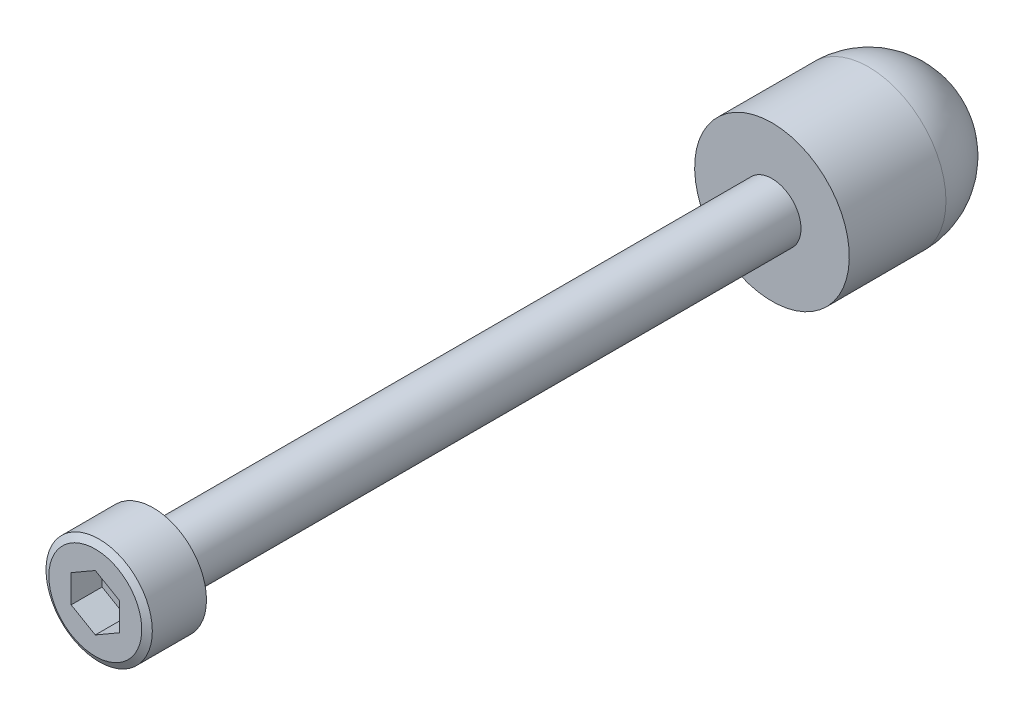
ISO-10303-21;
HEADER;
FILE_DESCRIPTION(('STEP AP214'),'2;1');
FILE_NAME('part.step','',(''),(''),'','','');
FILE_SCHEMA(('AUTOMOTIVE_DESIGN { 1 0 10303 214 1 1 1 1 }'));
ENDSEC;
DATA;
#1=APPLICATION_CONTEXT('core data for automotive mechanical design processes');
#2=APPLICATION_PROTOCOL_DEFINITION('international standard','automotive_design',2000,#1);
#3=PRODUCT_CONTEXT('',#1,'mechanical');
#4=PRODUCT('Part','Part','',(#3));
#5=PRODUCT_RELATED_PRODUCT_CATEGORY('part','',(#4));
#6=PRODUCT_DEFINITION_FORMATION('','',#4);
#7=PRODUCT_DEFINITION_CONTEXT('part definition',#1,'design');
#8=PRODUCT_DEFINITION('design','',#6,#7);
#9=PRODUCT_DEFINITION_SHAPE('','',#8);
#10=(LENGTH_UNIT() NAMED_UNIT(*) SI_UNIT(.MILLI.,.METRE.));
#11=(NAMED_UNIT(*) PLANE_ANGLE_UNIT() SI_UNIT($,.RADIAN.));
#12=(NAMED_UNIT(*) SI_UNIT($,.STERADIAN.) SOLID_ANGLE_UNIT());
#13=UNCERTAINTY_MEASURE_WITH_UNIT(LENGTH_MEASURE(1.E-05),#10,'distance_accuracy_value','');
#14=(GEOMETRIC_REPRESENTATION_CONTEXT(3) GLOBAL_UNCERTAINTY_ASSIGNED_CONTEXT((#13)) GLOBAL_UNIT_ASSIGNED_CONTEXT((#10,
#11,#12)) REPRESENTATION_CONTEXT('',''));
#15=CARTESIAN_POINT('',(0.,0.,0.));
#16=DIRECTION('',(0.,0.,1.));
#17=DIRECTION('',(1.,0.,0.));
#18=AXIS2_PLACEMENT_3D('',#15,#16,#17);
#19=CARTESIAN_POINT('',(-2.432432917,-2.44080280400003,44.));
#20=DIRECTION('',(0.,0.,1.));
#21=DIRECTION('',(1.,0.,0.));
#22=AXIS2_PLACEMENT_3D('',#19,#20,#21);
#23=PLANE('',#22);
#24=DIRECTION('',(-0.866025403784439,0.5,0.));
#25=VECTOR('',#24,1.);
#26=CARTESIAN_POINT('',(1.25,0.721687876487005,44.));
#27=LINE('',#26,#25);
#28=CARTESIAN_POINT('',(1.25,0.721687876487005,44.));
#29=VERTEX_POINT('',#28);
#30=CARTESIAN_POINT('',(0.,1.44337571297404,44.));
#31=VERTEX_POINT('',#30);
#32=EDGE_CURVE('E31',#29,#31,#27,.T.);
#33=ORIENTED_EDGE('',*,*,#32,.F.);
#34=DIRECTION('',(0.,1.,0.));
#35=VECTOR('',#34,1.);
#36=CARTESIAN_POINT('',(1.25,-0.721687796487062,44.));
#37=LINE('',#36,#35);
#38=CARTESIAN_POINT('',(1.25,-0.721687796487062,44.));
#39=VERTEX_POINT('',#38);
#40=EDGE_CURVE('E90',#39,#29,#37,.T.);
#41=ORIENTED_EDGE('',*,*,#40,.F.);
#42=DIRECTION('',(0.866025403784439,0.5,0.));
#43=VECTOR('',#42,1.);
#44=CARTESIAN_POINT('',(0.,-1.44337563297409,44.));
#45=LINE('',#44,#43);
#46=CARTESIAN_POINT('',(0.,-1.44337563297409,44.));
#47=VERTEX_POINT('',#46);
#48=EDGE_CURVE('E93',#47,#39,#45,.T.);
#49=ORIENTED_EDGE('',*,*,#48,.F.);
#50=DIRECTION('',(0.866025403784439,-0.5,0.));
#51=VECTOR('',#50,1.);
#52=CARTESIAN_POINT('',(-1.25,-0.72168779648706,44.));
#53=LINE('',#52,#51);
#54=CARTESIAN_POINT('',(-1.25,-0.72168779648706,44.));
#55=VERTEX_POINT('',#54);
#56=EDGE_CURVE('E109',#55,#47,#53,.T.);
#57=ORIENTED_EDGE('',*,*,#56,.F.);
#58=DIRECTION('',(0.,-1.,0.));
#59=VECTOR('',#58,1.);
#60=CARTESIAN_POINT('',(-1.25,0.721687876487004,44.));
#61=LINE('',#60,#59);
#62=CARTESIAN_POINT('',(-1.25,0.721687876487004,44.));
#63=VERTEX_POINT('',#62);
#64=EDGE_CURVE('E106',#63,#55,#61,.T.);
#65=ORIENTED_EDGE('',*,*,#64,.F.);
#66=DIRECTION('',(-0.866025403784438,-0.5,0.));
#67=VECTOR('',#66,1.);
#68=CARTESIAN_POINT('',(0.,1.44337571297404,44.));
#69=LINE('',#68,#67);
#70=EDGE_CURVE('E104',#31,#63,#69,.T.);
#71=ORIENTED_EDGE('',*,*,#70,.F.);
#72=EDGE_LOOP('',(#33,#41,#49,#57,#65,#71));
#73=FACE_BOUND('',#72,.T.);
#74=CARTESIAN_POINT('',(0.,3.99999715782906E-08,44.));
#75=DIRECTION('',(0.,0.,-1.));
#76=DIRECTION('',(-1.,0.,0.));
#77=AXIS2_PLACEMENT_3D('',#74,#75,#76);
#78=CIRCLE('',#77,2.403589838);
#79=CARTESIAN_POINT('',(-2.403589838,3.99999715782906E-08,44.));
#80=VERTEX_POINT('',#79);
#81=EDGE_CURVE('E18',#80,#80,#78,.T.);
#82=ORIENTED_EDGE('',*,*,#81,.F.);
#83=EDGE_LOOP('',(#82));
#84=FACE_BOUND('',#83,.T.);
#85=ADVANCED_FACE('F14',(#73,#84),#23,.T.);
#86=CARTESIAN_POINT('',(0.,3.99999715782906E-08,44.));
#87=DIRECTION('',(0.,0.,-1.));
#88=DIRECTION('',(-1.,0.,0.));
#89=AXIS2_PLACEMENT_3D('',#86,#87,#88);
#90=CONICAL_SURFACE('',#89,2.403589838,1.04719755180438);
#91=ORIENTED_EDGE('',*,*,#81,.T.);
#92=EDGE_LOOP('',(#91));
#93=FACE_BOUND('',#92,.T.);
#94=CARTESIAN_POINT('',(0.,3.99999715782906E-08,43.8));
#95=DIRECTION('',(0.,0.,1.));
#96=DIRECTION('',(1.,0.,0.));
#97=AXIS2_PLACEMENT_3D('',#94,#95,#96);
#98=CIRCLE('',#97,2.75);
#99=CARTESIAN_POINT('',(2.75,3.99999715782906E-08,43.8));
#100=VERTEX_POINT('',#99);
#101=EDGE_CURVE('E159',#100,#100,#98,.F.);
#102=ORIENTED_EDGE('',*,*,#101,.F.);
#103=EDGE_LOOP('',(#102));
#104=FACE_BOUND('',#103,.T.);
#105=ADVANCED_FACE('F138',(#93,#104),#90,.T.);
#106=CARTESIAN_POINT('',(0.,3.99999715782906E-08,41.));
#107=DIRECTION('',(0.,0.,1.));
#108=DIRECTION('',(1.,0.,0.));
#109=AXIS2_PLACEMENT_3D('',#106,#107,#108);
#110=CYLINDRICAL_SURFACE('',#109,2.75);
#111=CARTESIAN_POINT('',(0.,3.99999715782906E-08,41.));
#112=DIRECTION('',(0.,0.,1.));
#113=DIRECTION('',(1.,0.,0.));
#114=AXIS2_PLACEMENT_3D('',#111,#112,#113);
#115=CIRCLE('',#114,2.75);
#116=CARTESIAN_POINT('',(2.75,3.99999715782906E-08,41.));
#117=VERTEX_POINT('',#116);
#118=EDGE_CURVE('E158',#117,#117,#115,.F.);
#119=ORIENTED_EDGE('',*,*,#118,.F.);
#120=EDGE_LOOP('',(#119));
#121=FACE_BOUND('',#120,.T.);
#122=ORIENTED_EDGE('',*,*,#101,.T.);
#123=EDGE_LOOP('',(#122));
#124=FACE_BOUND('',#123,.T.);
#125=ADVANCED_FACE('F142',(#121,#124),#110,.T.);
#126=CARTESIAN_POINT('',(2.783,-2.79257617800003,41.));
#127=DIRECTION('',(0.,0.,-1.));
#128=DIRECTION('',(-1.,0.,0.));
#129=AXIS2_PLACEMENT_3D('',#126,#127,#128);
#130=PLANE('',#129);
#131=CARTESIAN_POINT('',(0.,3.99999715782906E-08,41.));
#132=DIRECTION('',(0.,0.,1.));
#133=DIRECTION('',(1.,0.,0.));
#134=AXIS2_PLACEMENT_3D('',#131,#132,#133);
#135=CIRCLE('',#134,1.5);
#136=CARTESIAN_POINT('',(1.5,3.99999715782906E-08,41.));
#137=VERTEX_POINT('',#136);
#138=EDGE_CURVE('E155',#137,#137,#135,.F.);
#139=ORIENTED_EDGE('',*,*,#138,.F.);
#140=EDGE_LOOP('',(#139));
#141=FACE_BOUND('',#140,.T.);
#142=ORIENTED_EDGE('',*,*,#118,.T.);
#143=EDGE_LOOP('',(#142));
#144=FACE_BOUND('',#143,.T.);
#145=ADVANCED_FACE('F140',(#141,#144),#130,.T.);
#146=CARTESIAN_POINT('',(0.,3.99999715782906E-08,9.));
#147=DIRECTION('',(0.,0.,1.));
#148=DIRECTION('',(1.,0.,0.));
#149=AXIS2_PLACEMENT_3D('',#146,#147,#148);
#150=CYLINDRICAL_SURFACE('',#149,1.5);
#151=CARTESIAN_POINT('',(0.,3.99999715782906E-08,9.));
#152=DIRECTION('',(0.,0.,1.));
#153=DIRECTION('',(1.,0.,0.));
#154=AXIS2_PLACEMENT_3D('',#151,#152,#153);
#155=CIRCLE('',#154,1.5);
#156=CARTESIAN_POINT('',(1.5,3.99999715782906E-08,9.));
#157=VERTEX_POINT('',#156);
#158=EDGE_CURVE('E160',#157,#157,#155,.F.);
#159=ORIENTED_EDGE('',*,*,#158,.F.);
#160=EDGE_LOOP('',(#159));
#161=FACE_BOUND('',#160,.T.);
#162=ORIENTED_EDGE('',*,*,#138,.T.);
#163=EDGE_LOOP('',(#162));
#164=FACE_BOUND('',#163,.T.);
#165=ADVANCED_FACE('F132',(#161,#164),#150,.T.);
#166=CARTESIAN_POINT('',(-4.048,-4.06192900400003,9.));
#167=DIRECTION('',(0.,0.,1.));
#168=DIRECTION('',(1.,0.,0.));
#169=AXIS2_PLACEMENT_3D('',#166,#167,#168);
#170=PLANE('',#169);
#171=ORIENTED_EDGE('',*,*,#158,.T.);
#172=EDGE_LOOP('',(#171));
#173=FACE_BOUND('',#172,.T.);
#174=CARTESIAN_POINT('',(0.,3.99999672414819E-08,9.));
#175=DIRECTION('',(0.,0.,1.));
#176=DIRECTION('',(0.,1.,0.));
#177=AXIS2_PLACEMENT_3D('',#174,#175,#176);
#178=CIRCLE('',#177,4.);
#179=CARTESIAN_POINT('',(0.,4.00000003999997,9.));
#180=VERTEX_POINT('',#179);
#181=EDGE_CURVE('E9',#180,#180,#178,.F.);
#182=ORIENTED_EDGE('',*,*,#181,.F.);
#183=EDGE_LOOP('',(#182));
#184=FACE_BOUND('',#183,.T.);
#185=ADVANCED_FACE('F16',(#173,#184),#170,.T.);
#186=CARTESIAN_POINT('',(0.,3.99999715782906E-08,4.));
#187=DIRECTION('',(0.,0.,1.));
#188=DIRECTION('',(0.,-1.,0.));
#189=AXIS2_PLACEMENT_3D('',#186,#187,#188);
#190=SPHERICAL_SURFACE('',#189,4.);
#191=CARTESIAN_POINT('',(0.,0.,0.));
#192=VERTEX_POINT('',#191);
#193=VERTEX_LOOP('',#192);
#194=FACE_BOUND('',#193,.T.);
#195=CARTESIAN_POINT('',(0.,3.99999715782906E-08,4.));
#196=DIRECTION('',(0.,0.,1.));
#197=DIRECTION('',(1.,0.,0.));
#198=AXIS2_PLACEMENT_3D('',#195,#196,#197);
#199=CIRCLE('',#198,4.);
#200=CARTESIAN_POINT('',(4.,3.99999715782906E-08,4.));
#201=VERTEX_POINT('',#200);
#202=EDGE_CURVE('E23',#201,#201,#199,.T.);
#203=ORIENTED_EDGE('',*,*,#202,.F.);
#204=EDGE_LOOP('',(#203));
#205=FACE_BOUND('',#204,.T.);
#206=ADVANCED_FACE('F127',(#194,#205),#190,.T.);
#207=CARTESIAN_POINT('',(0.,3.99999715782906E-08,4.));
#208=DIRECTION('',(0.,0.,1.));
#209=DIRECTION('',(0.,1.,0.));
#210=AXIS2_PLACEMENT_3D('',#207,#208,#209);
#211=CYLINDRICAL_SURFACE('',#210,4.);
#212=ORIENTED_EDGE('',*,*,#181,.T.);
#213=EDGE_LOOP('',(#212));
#214=FACE_BOUND('',#213,.T.);
#215=ORIENTED_EDGE('',*,*,#202,.T.);
#216=EDGE_LOOP('',(#215));
#217=FACE_BOUND('',#216,.T.);
#218=ADVANCED_FACE('F131',(#214,#217),#211,.T.);
#219=CARTESIAN_POINT('',(1.25,0.721687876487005,42.4));
#220=DIRECTION('',(0.5,0.866025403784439,0.));
#221=DIRECTION('',(-0.866025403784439,0.5,0.));
#222=AXIS2_PLACEMENT_3D('',#219,#220,#221);
#223=PLANE('',#222);
#224=ORIENTED_EDGE('',*,*,#32,.T.);
#225=DIRECTION('',(0.,0.,1.));
#226=VECTOR('',#225,1.);
#227=CARTESIAN_POINT('',(0.,1.44337571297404,42.4));
#228=LINE('',#227,#226);
#229=CARTESIAN_POINT('',(0.,1.44337571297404,42.4));
#230=VERTEX_POINT('',#229);
#231=EDGE_CURVE('E67',#230,#31,#228,.T.);
#232=ORIENTED_EDGE('',*,*,#231,.F.);
#233=DIRECTION('',(-0.866025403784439,0.5,0.));
#234=VECTOR('',#233,1.);
#235=CARTESIAN_POINT('',(1.25,0.721687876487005,42.4));
#236=LINE('',#235,#234);
#237=CARTESIAN_POINT('',(1.25,0.721687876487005,42.4));
#238=VERTEX_POINT('',#237);
#239=EDGE_CURVE('E71',#238,#230,#236,.T.);
#240=ORIENTED_EDGE('',*,*,#239,.F.);
#241=DIRECTION('',(0.,0.,1.));
#242=VECTOR('',#241,1.);
#243=CARTESIAN_POINT('',(1.25,0.721687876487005,42.4));
#244=LINE('',#243,#242);
#245=EDGE_CURVE('E114',#238,#29,#244,.T.);
#246=ORIENTED_EDGE('',*,*,#245,.T.);
#247=EDGE_LOOP('',(#224,#232,#240,#246));
#248=FACE_BOUND('',#247,.T.);
#249=ADVANCED_FACE('F69',(#248),#223,.F.);
#250=CARTESIAN_POINT('',(1.25,-0.721687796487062,42.4));
#251=DIRECTION('',(1.,0.,0.));
#252=DIRECTION('',(0.,0.,-1.));
#253=AXIS2_PLACEMENT_3D('',#250,#251,#252);
#254=PLANE('',#253);
#255=ORIENTED_EDGE('',*,*,#40,.T.);
#256=ORIENTED_EDGE('',*,*,#245,.F.);
#257=DIRECTION('',(0.,1.,0.));
#258=VECTOR('',#257,1.);
#259=CARTESIAN_POINT('',(1.25,-0.721687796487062,42.4));
#260=LINE('',#259,#258);
#261=CARTESIAN_POINT('',(1.25,-0.721687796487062,42.4));
#262=VERTEX_POINT('',#261);
#263=EDGE_CURVE('E77',#262,#238,#260,.T.);
#264=ORIENTED_EDGE('',*,*,#263,.F.);
#265=DIRECTION('',(0.,0.,1.));
#266=VECTOR('',#265,1.);
#267=CARTESIAN_POINT('',(1.25,-0.721687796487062,42.4));
#268=LINE('',#267,#266);
#269=EDGE_CURVE('E116',#262,#39,#268,.T.);
#270=ORIENTED_EDGE('',*,*,#269,.T.);
#271=EDGE_LOOP('',(#255,#256,#264,#270));
#272=FACE_BOUND('',#271,.T.);
#273=ADVANCED_FACE('F203',(#272),#254,.F.);
#274=CARTESIAN_POINT('',(0.,-1.44337563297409,42.4));
#275=DIRECTION('',(0.5,-0.866025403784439,0.));
#276=DIRECTION('',(0.866025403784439,0.5,0.));
#277=AXIS2_PLACEMENT_3D('',#274,#275,#276);
#278=PLANE('',#277);
#279=ORIENTED_EDGE('',*,*,#48,.T.);
#280=ORIENTED_EDGE('',*,*,#269,.F.);
#281=DIRECTION('',(0.866025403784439,0.5,0.));
#282=VECTOR('',#281,1.);
#283=CARTESIAN_POINT('',(0.,-1.44337563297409,42.4));
#284=LINE('',#283,#282);
#285=CARTESIAN_POINT('',(0.,-1.44337563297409,42.4));
#286=VERTEX_POINT('',#285);
#287=EDGE_CURVE('E100',#286,#262,#284,.T.);
#288=ORIENTED_EDGE('',*,*,#287,.F.);
#289=DIRECTION('',(0.,0.,1.));
#290=VECTOR('',#289,1.);
#291=CARTESIAN_POINT('',(0.,-1.44337563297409,42.4));
#292=LINE('',#291,#290);
#293=EDGE_CURVE('E118',#286,#47,#292,.T.);
#294=ORIENTED_EDGE('',*,*,#293,.T.);
#295=EDGE_LOOP('',(#279,#280,#288,#294));
#296=FACE_BOUND('',#295,.T.);
#297=ADVANCED_FACE('F211',(#296),#278,.F.);
#298=CARTESIAN_POINT('',(-1.25,-0.72168779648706,42.4));
#299=DIRECTION('',(-0.5,-0.866025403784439,0.));
#300=DIRECTION('',(0.866025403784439,-0.5,0.));
#301=AXIS2_PLACEMENT_3D('',#298,#299,#300);
#302=PLANE('',#301);
#303=ORIENTED_EDGE('',*,*,#56,.T.);
#304=ORIENTED_EDGE('',*,*,#293,.F.);
#305=DIRECTION('',(0.866025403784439,-0.5,0.));
#306=VECTOR('',#305,1.);
#307=CARTESIAN_POINT('',(-1.25,-0.72168779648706,42.4));
#308=LINE('',#307,#306);
#309=CARTESIAN_POINT('',(-1.25,-0.72168779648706,42.4));
#310=VERTEX_POINT('',#309);
#311=EDGE_CURVE('E97',#310,#286,#308,.T.);
#312=ORIENTED_EDGE('',*,*,#311,.F.);
#313=DIRECTION('',(0.,0.,1.));
#314=VECTOR('',#313,1.);
#315=CARTESIAN_POINT('',(-1.25,-0.72168779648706,42.4));
#316=LINE('',#315,#314);
#317=EDGE_CURVE('E120',#310,#55,#316,.T.);
#318=ORIENTED_EDGE('',*,*,#317,.T.);
#319=EDGE_LOOP('',(#303,#304,#312,#318));
#320=FACE_BOUND('',#319,.T.);
#321=ADVANCED_FACE('F220',(#320),#302,.F.);
#322=CARTESIAN_POINT('',(-1.25,0.721687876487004,42.4));
#323=DIRECTION('',(-1.,0.,0.));
#324=DIRECTION('',(0.,-1.,0.));
#325=AXIS2_PLACEMENT_3D('',#322,#323,#324);
#326=PLANE('',#325);
#327=ORIENTED_EDGE('',*,*,#64,.T.);
#328=ORIENTED_EDGE('',*,*,#317,.F.);
#329=DIRECTION('',(0.,-1.,0.));
#330=VECTOR('',#329,1.);
#331=CARTESIAN_POINT('',(-1.25,0.721687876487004,42.4));
#332=LINE('',#331,#330);
#333=CARTESIAN_POINT('',(-1.25,0.721687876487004,42.4));
#334=VERTEX_POINT('',#333);
#335=EDGE_CURVE('E85',#334,#310,#332,.T.);
#336=ORIENTED_EDGE('',*,*,#335,.F.);
#337=DIRECTION('',(0.,0.,1.));
#338=VECTOR('',#337,1.);
#339=CARTESIAN_POINT('',(-1.25,0.721687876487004,42.4));
#340=LINE('',#339,#338);
#341=EDGE_CURVE('E76',#334,#63,#340,.T.);
#342=ORIENTED_EDGE('',*,*,#341,.T.);
#343=EDGE_LOOP('',(#327,#328,#336,#342));
#344=FACE_BOUND('',#343,.T.);
#345=ADVANCED_FACE('F229',(#344),#326,.F.);
#346=CARTESIAN_POINT('',(0.,1.44337571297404,42.4));
#347=DIRECTION('',(-0.5,0.866025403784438,0.));
#348=DIRECTION('',(-0.866025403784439,-0.5,0.));
#349=AXIS2_PLACEMENT_3D('',#346,#347,#348);
#350=PLANE('',#349);
#351=ORIENTED_EDGE('',*,*,#70,.T.);
#352=ORIENTED_EDGE('',*,*,#341,.F.);
#353=DIRECTION('',(-0.866025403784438,-0.5,0.));
#354=VECTOR('',#353,1.);
#355=CARTESIAN_POINT('',(0.,1.44337571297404,42.4));
#356=LINE('',#355,#354);
#357=EDGE_CURVE('E80',#230,#334,#356,.T.);
#358=ORIENTED_EDGE('',*,*,#357,.F.);
#359=ORIENTED_EDGE('',*,*,#231,.T.);
#360=EDGE_LOOP('',(#351,#352,#358,#359));
#361=FACE_BOUND('',#360,.T.);
#362=ADVANCED_FACE('F81',(#361),#350,.F.);
#363=CARTESIAN_POINT('',(0.,1.44337571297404,42.4));
#364=DIRECTION('',(0.,0.,1.));
#365=DIRECTION('',(1.,0.,0.));
#366=AXIS2_PLACEMENT_3D('',#363,#364,#365);
#367=PLANE('',#366);
#368=ORIENTED_EDGE('',*,*,#239,.T.);
#369=ORIENTED_EDGE('',*,*,#357,.T.);
#370=ORIENTED_EDGE('',*,*,#335,.T.);
#371=ORIENTED_EDGE('',*,*,#311,.T.);
#372=ORIENTED_EDGE('',*,*,#287,.T.);
#373=ORIENTED_EDGE('',*,*,#263,.T.);
#374=EDGE_LOOP('',(#368,#369,#370,#371,#372,#373));
#375=FACE_BOUND('',#374,.T.);
#376=ADVANCED_FACE('F87',(#375),#367,.T.);
#377=CLOSED_SHELL('',(#85,#105,#125,#145,#165,#185,#206,#218,#249,#273,#297,#321,#345,#362,#376));
#378=MANIFOLD_SOLID_BREP('B1',#377);
#379=ADVANCED_BREP_SHAPE_REPRESENTATION('',(#18,#378),#14);
#380=SHAPE_DEFINITION_REPRESENTATION(#9,#379);
ENDSEC;
END-ISO-10303-21;
